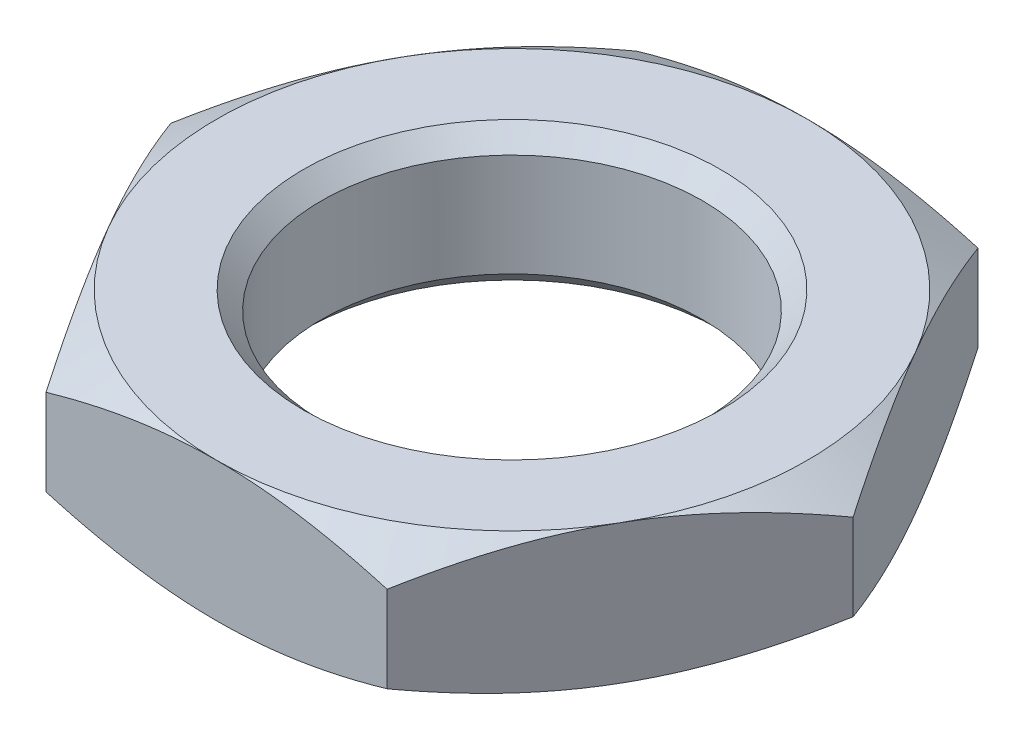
ISO-10303-21;
HEADER;
FILE_DESCRIPTION(('STEP AP214'),'2;1');
FILE_NAME('part.step','',(''),(''),'','','');
FILE_SCHEMA(('AUTOMOTIVE_DESIGN { 1 0 10303 214 1 1 1 1 }'));
ENDSEC;
DATA;
#1=APPLICATION_CONTEXT('core data for automotive mechanical design processes');
#2=APPLICATION_PROTOCOL_DEFINITION('international standard','automotive_design',2000,#1);
#3=PRODUCT_CONTEXT('',#1,'mechanical');
#4=PRODUCT('Part','Part','',(#3));
#5=PRODUCT_RELATED_PRODUCT_CATEGORY('part','',(#4));
#6=PRODUCT_DEFINITION_FORMATION('','',#4);
#7=PRODUCT_DEFINITION_CONTEXT('part definition',#1,'design');
#8=PRODUCT_DEFINITION('design','',#6,#7);
#9=PRODUCT_DEFINITION_SHAPE('','',#8);
#10=(LENGTH_UNIT() NAMED_UNIT(*) SI_UNIT(.MILLI.,.METRE.));
#11=(NAMED_UNIT(*) PLANE_ANGLE_UNIT() SI_UNIT($,.RADIAN.));
#12=(NAMED_UNIT(*) SI_UNIT($,.STERADIAN.) SOLID_ANGLE_UNIT());
#13=UNCERTAINTY_MEASURE_WITH_UNIT(LENGTH_MEASURE(1.E-05),#10,'distance_accuracy_value','');
#14=(GEOMETRIC_REPRESENTATION_CONTEXT(3) GLOBAL_UNCERTAINTY_ASSIGNED_CONTEXT((#13)) GLOBAL_UNIT_ASSIGNED_CONTEXT((#10,
#11,#12)) REPRESENTATION_CONTEXT('',''));
#15=CARTESIAN_POINT('',(0.,0.,0.));
#16=DIRECTION('',(0.,0.,1.));
#17=DIRECTION('',(1.,0.,0.));
#18=AXIS2_PLACEMENT_3D('',#15,#16,#17);
#19=CARTESIAN_POINT('',(7.25,-4.,0.));
#20=DIRECTION('',(0.,1.,0.));
#21=DIRECTION('',(0.,0.,1.));
#22=AXIS2_PLACEMENT_3D('',#19,#20,#21);
#23=PLANE('',#22);
#24=CARTESIAN_POINT('',(0.,-3.99999999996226,0.));
#25=DIRECTION('',(0.,1.,0.));
#26=DIRECTION('',(0.,0.,1.));
#27=AXIS2_PLACEMENT_3D('',#24,#25,#26);
#28=CIRCLE('',#27,6.00000000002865);
#29=CARTESIAN_POINT('',(0.,-3.99999999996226,6.00000000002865));
#30=VERTEX_POINT('',#29);
#31=EDGE_CURVE('E269',#30,#30,#28,.F.);
#32=ORIENTED_EDGE('',*,*,#31,.T.);
#33=EDGE_LOOP('',(#32));
#34=FACE_BOUND('',#33,.T.);
#35=CARTESIAN_POINT('',(0.,-4.,0.));
#36=DIRECTION('',(0.,-1.,0.));
#37=DIRECTION('',(0.,0.,-1.));
#38=AXIS2_PLACEMENT_3D('',#35,#36,#37);
#39=CIRCLE('',#38,8.5);
#40=CARTESIAN_POINT('',(0.,-4.,8.5));
#41=VERTEX_POINT('',#40);
#42=CARTESIAN_POINT('',(-7.36121593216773,-4.,4.25));
#43=VERTEX_POINT('',#42);
#44=EDGE_CURVE('E103',#41,#43,#39,.T.);
#45=ORIENTED_EDGE('',*,*,#44,.F.);
#46=CARTESIAN_POINT('',(0.,-4.,0.));
#47=DIRECTION('',(0.,-1.,0.));
#48=DIRECTION('',(0.,0.,-1.));
#49=AXIS2_PLACEMENT_3D('',#46,#47,#48);
#50=CIRCLE('',#49,8.5);
#51=CARTESIAN_POINT('',(7.36121593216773,-4.,4.25));
#52=VERTEX_POINT('',#51);
#53=EDGE_CURVE('E19',#52,#41,#50,.T.);
#54=ORIENTED_EDGE('',*,*,#53,.F.);
#55=CARTESIAN_POINT('',(0.,-4.,0.));
#56=DIRECTION('',(0.,-1.,0.));
#57=DIRECTION('',(0.,0.,-1.));
#58=AXIS2_PLACEMENT_3D('',#55,#56,#57);
#59=CIRCLE('',#58,8.5);
#60=CARTESIAN_POINT('',(7.36121593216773,-4.,-4.25));
#61=VERTEX_POINT('',#60);
#62=EDGE_CURVE('E543',#61,#52,#59,.T.);
#63=ORIENTED_EDGE('',*,*,#62,.F.);
#64=CARTESIAN_POINT('',(0.,-4.,0.));
#65=DIRECTION('',(0.,-1.,0.));
#66=DIRECTION('',(0.,0.,-1.));
#67=AXIS2_PLACEMENT_3D('',#64,#65,#66);
#68=CIRCLE('',#67,8.5);
#69=CARTESIAN_POINT('',(0.,-4.00000000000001,-8.5));
#70=VERTEX_POINT('',#69);
#71=EDGE_CURVE('E545',#70,#61,#68,.T.);
#72=ORIENTED_EDGE('',*,*,#71,.F.);
#73=CARTESIAN_POINT('',(0.,-4.,0.));
#74=DIRECTION('',(0.,-1.,0.));
#75=DIRECTION('',(0.,0.,-1.));
#76=AXIS2_PLACEMENT_3D('',#73,#74,#75);
#77=CIRCLE('',#76,8.5);
#78=CARTESIAN_POINT('',(-7.36121593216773,-4.,-4.25));
#79=VERTEX_POINT('',#78);
#80=EDGE_CURVE('E548',#79,#70,#77,.T.);
#81=ORIENTED_EDGE('',*,*,#80,.F.);
#82=CARTESIAN_POINT('',(0.,-4.,0.));
#83=DIRECTION('',(0.,-1.,0.));
#84=DIRECTION('',(0.,0.,-1.));
#85=AXIS2_PLACEMENT_3D('',#82,#83,#84);
#86=CIRCLE('',#85,8.5);
#87=EDGE_CURVE('E107',#43,#79,#86,.T.);
#88=ORIENTED_EDGE('',*,*,#87,.F.);
#89=EDGE_LOOP('',(#45,#54,#63,#72,#81,#88));
#90=FACE_BOUND('',#89,.T.);
#91=ADVANCED_FACE('F16',(#34,#90),#23,.T.);
#92=CARTESIAN_POINT('',(0.,-4.76374451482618,0.));
#93=DIRECTION('',(0.,-1.,0.));
#94=DIRECTION('',(0.,0.,-1.));
#95=AXIS2_PLACEMENT_3D('',#92,#93,#94);
#96=CONICAL_SURFACE('',#95,9.82284430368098,1.0471975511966);
#97=CARTESIAN_POINT('',(7.36121593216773,-4.00000000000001,4.25));
#98=CARTESIAN_POINT('',(7.25706849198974,-3.99996526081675,4.43038865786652));
#99=CARTESIAN_POINT('',(7.15292606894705,-4.004419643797,4.61076862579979));
#100=CARTESIAN_POINT('',(6.9448457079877,-4.02204845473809,4.97117438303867));
#101=CARTESIAN_POINT('',(6.84090773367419,-4.03522115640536,5.15120023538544));
#102=CARTESIAN_POINT('',(6.63390762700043,-4.06994166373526,5.50973493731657));
#103=CARTESIAN_POINT('',(6.53084371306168,-4.09144730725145,5.6882468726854));
#104=CARTESIAN_POINT('',(6.32520691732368,-4.14237110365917,6.04442025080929));
#105=CARTESIAN_POINT('',(6.22263404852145,-4.17178946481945,6.22208167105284));
#106=CARTESIAN_POINT('',(5.91607718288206,-4.27100481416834,6.75305373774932));
#107=CARTESIAN_POINT('',(5.71298374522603,-4.35181024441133,7.10482189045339));
#108=CARTESIAN_POINT('',(5.3085433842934,-4.53816823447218,7.80533314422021));
#109=CARTESIAN_POINT('',(5.1072105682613,-4.64384438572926,8.15405181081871));
#110=CARTESIAN_POINT('',(4.90747728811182,-4.75918937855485,8.5));
#111=B_SPLINE_CURVE_WITH_KNOTS('',3,(#97,#98,#99,#100,#101,#102,#103,#104,#105,#106,#107,#108,
#109,#110),.UNSPECIFIED.,.F.,.F.,(4,2,2,2,2,2,4),(0.,0.624820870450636,1.24951805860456,
1.87109489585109,2.49268809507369,3.73424531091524,4.98210763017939),.UNSPECIFIED.);
#112=CARTESIAN_POINT('',(4.90747728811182,-4.75918937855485,8.5));
#113=VERTEX_POINT('',#112);
#114=EDGE_CURVE('E118',#52,#113,#111,.T.);
#115=ORIENTED_EDGE('',*,*,#114,.F.);
#116=ORIENTED_EDGE('',*,*,#53,.T.);
#117=CARTESIAN_POINT('',(4.90747728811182,-4.75918937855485,8.5));
#118=CARTESIAN_POINT('',(4.50801072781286,-4.64384438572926,8.5));
#119=CARTESIAN_POINT('',(4.10534509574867,-4.53816823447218,8.5));
#120=CARTESIAN_POINT('',(3.2964643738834,-4.35181024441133,8.5));
#121=CARTESIAN_POINT('',(2.89027749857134,-4.27100481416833,8.5));
#122=CARTESIAN_POINT('',(2.27716376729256,-4.17178946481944,8.5));
#123=CARTESIAN_POINT('',(2.07201802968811,-4.14237110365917,8.5));
#124=CARTESIAN_POINT('',(1.66074443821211,-4.09144730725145,8.5));
#125=CARTESIAN_POINT('',(1.45461661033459,-4.06994166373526,8.5));
#126=CARTESIAN_POINT('',(1.04061639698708,-4.03522115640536,8.5));
#127=CARTESIAN_POINT('',(0.832740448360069,-4.02204845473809,8.5));
#128=CARTESIAN_POINT('',(0.416579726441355,-4.004419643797,8.5));
#129=CARTESIAN_POINT('',(0.208294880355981,-3.99996526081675,8.5));
#130=CARTESIAN_POINT('',(0.,-4.00000000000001,8.5));
#131=B_SPLINE_CURVE_WITH_KNOTS('',3,(#117,#118,#119,#120,#121,#122,#123,#124,#125,#126,#127,
#128,#129,#130),.UNSPECIFIED.,.F.,.F.,(4,2,2,2,2,2,4),(0.,1.24786231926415,2.4894195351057,
3.11101273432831,3.73258957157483,4.35728675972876,4.98210763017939),.UNSPECIFIED.);
#132=EDGE_CURVE('E116',#113,#41,#131,.T.);
#133=ORIENTED_EDGE('',*,*,#132,.F.);
#134=EDGE_LOOP('',(#115,#116,#133));
#135=FACE_BOUND('',#134,.T.);
#136=ADVANCED_FACE('F114',(#135),#96,.T.);
#137=CARTESIAN_POINT('',(0.,-4.76374451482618,0.));
#138=DIRECTION('',(0.,-1.,0.));
#139=DIRECTION('',(0.,0.,-1.));
#140=AXIS2_PLACEMENT_3D('',#137,#138,#139);
#141=CONICAL_SURFACE('',#140,9.82284430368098,1.0471975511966);
#142=ORIENTED_EDGE('',*,*,#44,.T.);
#143=CARTESIAN_POINT('',(-4.90747728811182,-4.75918937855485,8.5));
#144=CARTESIAN_POINT('',(-5.1072105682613,-4.64384438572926,8.15405181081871));
#145=CARTESIAN_POINT('',(-5.3085433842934,-4.53816823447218,7.8053331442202));
#146=CARTESIAN_POINT('',(-5.71298374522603,-4.35181024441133,7.10482189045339));
#147=CARTESIAN_POINT('',(-5.91607718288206,-4.27100481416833,6.75305373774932));
#148=CARTESIAN_POINT('',(-6.22263404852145,-4.17178946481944,6.22208167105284));
#149=CARTESIAN_POINT('',(-6.32520691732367,-4.14237110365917,6.04442025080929));
#150=CARTESIAN_POINT('',(-6.53084371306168,-4.09144730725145,5.6882468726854));
#151=CARTESIAN_POINT('',(-6.63390762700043,-4.06994166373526,5.50973493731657));
#152=CARTESIAN_POINT('',(-6.84090773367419,-4.03522115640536,5.15120023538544));
#153=CARTESIAN_POINT('',(-6.94484570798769,-4.02204845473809,4.97117438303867));
#154=CARTESIAN_POINT('',(-7.15292606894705,-4.004419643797,4.61076862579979));
#155=CARTESIAN_POINT('',(-7.25706849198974,-3.99996526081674,4.43038865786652));
#156=CARTESIAN_POINT('',(-7.36121593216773,-4.00000000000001,4.25));
#157=B_SPLINE_CURVE_WITH_KNOTS('',3,(#143,#144,#145,#146,#147,#148,#149,#150,#151,#152,#153,
#154,#155,#156),.UNSPECIFIED.,.F.,.F.,(4,2,2,2,2,2,4),(0.,1.24786231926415,2.4894195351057,
3.1110127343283,3.73258957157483,4.35728675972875,4.98210763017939),.UNSPECIFIED.);
#158=CARTESIAN_POINT('',(-4.90747728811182,-4.75918937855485,8.5));
#159=VERTEX_POINT('',#158);
#160=EDGE_CURVE('E123',#159,#43,#157,.T.);
#161=ORIENTED_EDGE('',*,*,#160,.F.);
#162=CARTESIAN_POINT('',(0.,-4.00000000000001,8.5));
#163=CARTESIAN_POINT('',(-0.208294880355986,-3.99996526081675,8.5));
#164=CARTESIAN_POINT('',(-0.416579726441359,-4.004419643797,8.5));
#165=CARTESIAN_POINT('',(-0.832740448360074,-4.02204845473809,8.5));
#166=CARTESIAN_POINT('',(-1.04061639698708,-4.03522115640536,8.5));
#167=CARTESIAN_POINT('',(-1.4546166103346,-4.06994166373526,8.5));
#168=CARTESIAN_POINT('',(-1.66074443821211,-4.09144730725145,8.5));
#169=CARTESIAN_POINT('',(-2.07201802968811,-4.14237110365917,8.5));
#170=CARTESIAN_POINT('',(-2.27716376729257,-4.17178946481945,8.5));
#171=CARTESIAN_POINT('',(-2.89027749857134,-4.27100481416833,8.5));
#172=CARTESIAN_POINT('',(-3.2964643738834,-4.35181024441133,8.5));
#173=CARTESIAN_POINT('',(-4.10534509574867,-4.53816823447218,8.5));
#174=CARTESIAN_POINT('',(-4.50801072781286,-4.64384438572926,8.5));
#175=CARTESIAN_POINT('',(-4.90747728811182,-4.75918937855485,8.5));
#176=B_SPLINE_CURVE_WITH_KNOTS('',3,(#162,#163,#164,#165,#166,#167,#168,#169,#170,#171,#172,
#173,#174,#175),.UNSPECIFIED.,.F.,.F.,(4,2,2,2,2,2,4),(0.,0.624820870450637,1.24951805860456,
1.87109489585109,2.49268809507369,3.73424531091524,4.98210763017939),.UNSPECIFIED.);
#177=EDGE_CURVE('E120',#41,#159,#176,.T.);
#178=ORIENTED_EDGE('',*,*,#177,.F.);
#179=EDGE_LOOP('',(#142,#161,#178));
#180=FACE_BOUND('',#179,.T.);
#181=ADVANCED_FACE('F121',(#180),#141,.T.);
#182=CARTESIAN_POINT('',(0.,-4.76374451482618,0.));
#183=DIRECTION('',(0.,-1.,0.));
#184=DIRECTION('',(0.,0.,-1.));
#185=AXIS2_PLACEMENT_3D('',#182,#183,#184);
#186=CONICAL_SURFACE('',#185,9.82284430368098,1.0471975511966);
#187=ORIENTED_EDGE('',*,*,#87,.T.);
#188=CARTESIAN_POINT('',(-9.81495457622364,-4.75918937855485,0.));
#189=CARTESIAN_POINT('',(-9.61522129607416,-4.64384438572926,-0.345948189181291));
#190=CARTESIAN_POINT('',(-9.41388848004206,-4.53816823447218,-0.694666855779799));
#191=CARTESIAN_POINT('',(-9.00944811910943,-4.35181024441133,-1.39517810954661));
#192=CARTESIAN_POINT('',(-8.8063546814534,-4.27100481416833,-1.74694626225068));
#193=CARTESIAN_POINT('',(-8.49979781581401,-4.17178946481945,-2.27791832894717));
#194=CARTESIAN_POINT('',(-8.39722494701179,-4.14237110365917,-2.45557974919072));
#195=CARTESIAN_POINT('',(-8.19158815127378,-4.09144730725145,-2.8117531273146));
#196=CARTESIAN_POINT('',(-8.08852423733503,-4.06994166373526,-2.99026506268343));
#197=CARTESIAN_POINT('',(-7.88152413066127,-4.03522115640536,-3.34879976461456));
#198=CARTESIAN_POINT('',(-7.77758615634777,-4.02204845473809,-3.52882561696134));
#199=CARTESIAN_POINT('',(-7.56950579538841,-4.004419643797,-3.88923137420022));
#200=CARTESIAN_POINT('',(-7.46536337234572,-3.99996526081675,-4.06961134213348));
#201=CARTESIAN_POINT('',(-7.36121593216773,-4.00000000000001,-4.25));
#202=B_SPLINE_CURVE_WITH_KNOTS('',3,(#188,#189,#190,#191,#192,#193,#194,#195,#196,#197,#198,
#199,#200,#201),.UNSPECIFIED.,.F.,.F.,(4,2,2,2,2,2,4),(0.,1.24786231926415,2.48941953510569,
3.1110127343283,3.73258957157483,4.35728675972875,4.98210763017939),.UNSPECIFIED.);
#203=CARTESIAN_POINT('',(-9.81495457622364,-4.75918937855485,0.));
#204=VERTEX_POINT('',#203);
#205=EDGE_CURVE('E381',#204,#79,#202,.T.);
#206=ORIENTED_EDGE('',*,*,#205,.F.);
#207=CARTESIAN_POINT('',(-7.36121593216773,-4.00000000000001,4.25));
#208=CARTESIAN_POINT('',(-7.46536337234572,-3.99996526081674,4.06961134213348));
#209=CARTESIAN_POINT('',(-7.56950579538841,-4.004419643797,3.88923137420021));
#210=CARTESIAN_POINT('',(-7.77758615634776,-4.02204845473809,3.52882561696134));
#211=CARTESIAN_POINT('',(-7.88152413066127,-4.03522115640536,3.34879976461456));
#212=CARTESIAN_POINT('',(-8.08852423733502,-4.06994166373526,2.99026506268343));
#213=CARTESIAN_POINT('',(-8.19158815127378,-4.09144730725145,2.8117531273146));
#214=CARTESIAN_POINT('',(-8.39722494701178,-4.14237110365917,2.45557974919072));
#215=CARTESIAN_POINT('',(-8.49979781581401,-4.17178946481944,2.27791832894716));
#216=CARTESIAN_POINT('',(-8.8063546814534,-4.27100481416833,1.74694626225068));
#217=CARTESIAN_POINT('',(-9.00944811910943,-4.35181024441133,1.39517810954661));
#218=CARTESIAN_POINT('',(-9.41388848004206,-4.53816823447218,0.694666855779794));
#219=CARTESIAN_POINT('',(-9.61522129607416,-4.64384438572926,0.345948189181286));
#220=CARTESIAN_POINT('',(-9.81495457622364,-4.75918937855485,0.));
#221=B_SPLINE_CURVE_WITH_KNOTS('',3,(#207,#208,#209,#210,#211,#212,#213,#214,#215,#216,#217,
#218,#219,#220),.UNSPECIFIED.,.F.,.F.,(4,2,2,2,2,2,4),(0.,0.624820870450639,1.24951805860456,
1.87109489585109,2.4926880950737,3.73424531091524,4.98210763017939),.UNSPECIFIED.);
#222=EDGE_CURVE('E164',#43,#204,#221,.T.);
#223=ORIENTED_EDGE('',*,*,#222,.F.);
#224=EDGE_LOOP('',(#187,#206,#223));
#225=FACE_BOUND('',#224,.T.);
#226=ADVANCED_FACE('F156',(#225),#186,.T.);
#227=CARTESIAN_POINT('',(0.,-4.76374451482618,0.));
#228=DIRECTION('',(0.,-1.,0.));
#229=DIRECTION('',(0.,0.,-1.));
#230=AXIS2_PLACEMENT_3D('',#227,#228,#229);
#231=CONICAL_SURFACE('',#230,9.82284430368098,1.0471975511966);
#232=ORIENTED_EDGE('',*,*,#80,.T.);
#233=CARTESIAN_POINT('',(-4.90747728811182,-4.75918937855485,-8.5));
#234=CARTESIAN_POINT('',(-4.50801072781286,-4.64384438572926,-8.5));
#235=CARTESIAN_POINT('',(-4.10534509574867,-4.53816823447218,-8.5));
#236=CARTESIAN_POINT('',(-3.2964643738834,-4.35181024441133,-8.5));
#237=CARTESIAN_POINT('',(-2.89027749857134,-4.27100481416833,-8.5));
#238=CARTESIAN_POINT('',(-2.27716376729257,-4.17178946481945,-8.5));
#239=CARTESIAN_POINT('',(-2.07201802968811,-4.14237110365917,-8.5));
#240=CARTESIAN_POINT('',(-1.66074443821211,-4.09144730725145,-8.5));
#241=CARTESIAN_POINT('',(-1.4546166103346,-4.06994166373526,-8.5));
#242=CARTESIAN_POINT('',(-1.04061639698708,-4.03522115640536,-8.5));
#243=CARTESIAN_POINT('',(-0.832740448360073,-4.02204845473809,-8.5));
#244=CARTESIAN_POINT('',(-0.416579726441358,-4.004419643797,-8.5));
#245=CARTESIAN_POINT('',(-0.208294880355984,-3.99996526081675,-8.5));
#246=CARTESIAN_POINT('',(0.,-4.00000000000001,-8.5));
#247=B_SPLINE_CURVE_WITH_KNOTS('',3,(#233,#234,#235,#236,#237,#238,#239,#240,#241,#242,#243,
#244,#245,#246),.UNSPECIFIED.,.F.,.F.,(4,2,2,2,2,2,4),(0.,1.24786231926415,2.4894195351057,
3.1110127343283,3.73258957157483,4.35728675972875,4.98210763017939),.UNSPECIFIED.);
#248=CARTESIAN_POINT('',(-4.90747728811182,-4.75918937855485,-8.5));
#249=VERTEX_POINT('',#248);
#250=EDGE_CURVE('E376',#249,#70,#247,.T.);
#251=ORIENTED_EDGE('',*,*,#250,.F.);
#252=CARTESIAN_POINT('',(-7.36121593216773,-4.00000000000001,-4.25));
#253=CARTESIAN_POINT('',(-7.25706849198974,-3.99996526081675,-4.43038865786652));
#254=CARTESIAN_POINT('',(-7.15292606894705,-4.004419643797,-4.61076862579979));
#255=CARTESIAN_POINT('',(-6.9448457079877,-4.02204845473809,-4.97117438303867));
#256=CARTESIAN_POINT('',(-6.84090773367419,-4.03522115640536,-5.15120023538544));
#257=CARTESIAN_POINT('',(-6.63390762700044,-4.06994166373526,-5.50973493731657));
#258=CARTESIAN_POINT('',(-6.53084371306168,-4.09144730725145,-5.6882468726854));
#259=CARTESIAN_POINT('',(-6.32520691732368,-4.14237110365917,-6.04442025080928));
#260=CARTESIAN_POINT('',(-6.22263404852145,-4.17178946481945,-6.22208167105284));
#261=CARTESIAN_POINT('',(-5.91607718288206,-4.27100481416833,-6.75305373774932));
#262=CARTESIAN_POINT('',(-5.71298374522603,-4.35181024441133,-7.10482189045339));
#263=CARTESIAN_POINT('',(-5.3085433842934,-4.53816823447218,-7.8053331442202));
#264=CARTESIAN_POINT('',(-5.1072105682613,-4.64384438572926,-8.15405181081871));
#265=CARTESIAN_POINT('',(-4.90747728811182,-4.75918937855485,-8.5));
#266=B_SPLINE_CURVE_WITH_KNOTS('',3,(#252,#253,#254,#255,#256,#257,#258,#259,#260,#261,#262,
#263,#264,#265),.UNSPECIFIED.,.F.,.F.,(4,2,2,2,2,2,4),(0.,0.624820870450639,1.24951805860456,
1.87109489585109,2.49268809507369,3.73424531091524,4.98210763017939),.UNSPECIFIED.);
#267=EDGE_CURVE('E377',#79,#249,#266,.T.);
#268=ORIENTED_EDGE('',*,*,#267,.F.);
#269=EDGE_LOOP('',(#232,#251,#268));
#270=FACE_BOUND('',#269,.T.);
#271=ADVANCED_FACE('F280',(#270),#231,.T.);
#272=CARTESIAN_POINT('',(0.,-4.76374451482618,0.));
#273=DIRECTION('',(0.,-1.,0.));
#274=DIRECTION('',(0.,0.,-1.));
#275=AXIS2_PLACEMENT_3D('',#272,#273,#274);
#276=CONICAL_SURFACE('',#275,9.82284430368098,1.0471975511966);
#277=CARTESIAN_POINT('',(0.,-4.00000000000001,-8.5));
#278=CARTESIAN_POINT('',(0.208294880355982,-3.99996526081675,-8.5));
#279=CARTESIAN_POINT('',(0.416579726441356,-4.004419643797,-8.5));
#280=CARTESIAN_POINT('',(0.832740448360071,-4.02204845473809,-8.5));
#281=CARTESIAN_POINT('',(1.04061639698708,-4.03522115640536,-8.5));
#282=CARTESIAN_POINT('',(1.45461661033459,-4.06994166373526,-8.5));
#283=CARTESIAN_POINT('',(1.66074443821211,-4.09144730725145,-8.5));
#284=CARTESIAN_POINT('',(2.07201802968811,-4.14237110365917,-8.5));
#285=CARTESIAN_POINT('',(2.27716376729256,-4.17178946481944,-8.5));
#286=CARTESIAN_POINT('',(2.89027749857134,-4.27100481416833,-8.5));
#287=CARTESIAN_POINT('',(3.2964643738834,-4.35181024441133,-8.5));
#288=CARTESIAN_POINT('',(4.10534509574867,-4.53816823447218,-8.5));
#289=CARTESIAN_POINT('',(4.50801072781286,-4.64384438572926,-8.5));
#290=CARTESIAN_POINT('',(4.90747728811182,-4.75918937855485,-8.5));
#291=B_SPLINE_CURVE_WITH_KNOTS('',3,(#277,#278,#279,#280,#281,#282,#283,#284,#285,#286,#287,
#288,#289,#290),.UNSPECIFIED.,.F.,.F.,(4,2,2,2,2,2,4),(0.,0.624820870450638,1.24951805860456,
1.87109489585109,2.4926880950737,3.73424531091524,4.98210763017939),.UNSPECIFIED.);
#292=CARTESIAN_POINT('',(4.90747728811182,-4.75918937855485,-8.5));
#293=VERTEX_POINT('',#292);
#294=EDGE_CURVE('E285',#70,#293,#291,.T.);
#295=ORIENTED_EDGE('',*,*,#294,.F.);
#296=ORIENTED_EDGE('',*,*,#71,.T.);
#297=CARTESIAN_POINT('',(4.90747728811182,-4.75918937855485,-8.5));
#298=CARTESIAN_POINT('',(5.1072105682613,-4.64384438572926,-8.15405181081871));
#299=CARTESIAN_POINT('',(5.3085433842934,-4.53816823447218,-7.8053331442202));
#300=CARTESIAN_POINT('',(5.71298374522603,-4.35181024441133,-7.10482189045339));
#301=CARTESIAN_POINT('',(5.91607718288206,-4.27100481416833,-6.75305373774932));
#302=CARTESIAN_POINT('',(6.22263404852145,-4.17178946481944,-6.22208167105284));
#303=CARTESIAN_POINT('',(6.32520691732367,-4.14237110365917,-6.04442025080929));
#304=CARTESIAN_POINT('',(6.53084371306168,-4.09144730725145,-5.6882468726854));
#305=CARTESIAN_POINT('',(6.63390762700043,-4.06994166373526,-5.50973493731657));
#306=CARTESIAN_POINT('',(6.84090773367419,-4.03522115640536,-5.15120023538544));
#307=CARTESIAN_POINT('',(6.94484570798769,-4.02204845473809,-4.97117438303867));
#308=CARTESIAN_POINT('',(7.15292606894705,-4.004419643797,-4.61076862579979));
#309=CARTESIAN_POINT('',(7.25706849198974,-3.99996526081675,-4.43038865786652));
#310=CARTESIAN_POINT('',(7.36121593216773,-4.00000000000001,-4.25));
#311=B_SPLINE_CURVE_WITH_KNOTS('',3,(#297,#298,#299,#300,#301,#302,#303,#304,#305,#306,#307,
#308,#309,#310),.UNSPECIFIED.,.F.,.F.,(4,2,2,2,2,2,4),(0.,1.24786231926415,2.48941953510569,
3.1110127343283,3.73258957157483,4.35728675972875,4.98210763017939),.UNSPECIFIED.);
#312=EDGE_CURVE('E290',#293,#61,#311,.T.);
#313=ORIENTED_EDGE('',*,*,#312,.F.);
#314=EDGE_LOOP('',(#295,#296,#313));
#315=FACE_BOUND('',#314,.T.);
#316=ADVANCED_FACE('F275',(#315),#276,.T.);
#317=CARTESIAN_POINT('',(0.,-4.76374451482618,0.));
#318=DIRECTION('',(0.,-1.,0.));
#319=DIRECTION('',(0.,0.,-1.));
#320=AXIS2_PLACEMENT_3D('',#317,#318,#319);
#321=CONICAL_SURFACE('',#320,9.82284430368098,1.0471975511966);
#322=CARTESIAN_POINT('',(7.36121593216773,-4.,-4.25));
#323=CARTESIAN_POINT('',(7.46536337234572,-3.99996526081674,-4.06961134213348));
#324=CARTESIAN_POINT('',(7.56950579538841,-4.004419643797,-3.88923137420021));
#325=CARTESIAN_POINT('',(7.77758615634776,-4.02204845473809,-3.52882561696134));
#326=CARTESIAN_POINT('',(7.88152413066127,-4.03522115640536,-3.34879976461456));
#327=CARTESIAN_POINT('',(8.08852423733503,-4.06994166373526,-2.99026506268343));
#328=CARTESIAN_POINT('',(8.19158815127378,-4.09144730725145,-2.8117531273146));
#329=CARTESIAN_POINT('',(8.39722494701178,-4.14237110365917,-2.45557974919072));
#330=CARTESIAN_POINT('',(8.49979781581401,-4.17178946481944,-2.27791832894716));
#331=CARTESIAN_POINT('',(8.8063546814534,-4.27100481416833,-1.74694626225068));
#332=CARTESIAN_POINT('',(9.00944811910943,-4.35181024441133,-1.39517810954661));
#333=CARTESIAN_POINT('',(9.41388848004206,-4.53816823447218,-0.694666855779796));
#334=CARTESIAN_POINT('',(9.61522129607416,-4.64384438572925,-0.345948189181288));
#335=CARTESIAN_POINT('',(9.81495457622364,-4.75918937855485,0.));
#336=B_SPLINE_CURVE_WITH_KNOTS('',3,(#322,#323,#324,#325,#326,#327,#328,#329,#330,#331,#332,
#333,#334,#335),.UNSPECIFIED.,.F.,.F.,(4,2,2,2,2,2,4),(0.,0.624820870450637,1.24951805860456,
1.87109489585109,2.4926880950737,3.73424531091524,4.98210763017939),.UNSPECIFIED.);
#337=CARTESIAN_POINT('',(9.81495457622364,-4.75918937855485,0.));
#338=VERTEX_POINT('',#337);
#339=EDGE_CURVE('E246',#61,#338,#336,.T.);
#340=ORIENTED_EDGE('',*,*,#339,.F.);
#341=ORIENTED_EDGE('',*,*,#62,.T.);
#342=CARTESIAN_POINT('',(9.81495457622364,-4.75918937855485,0.));
#343=CARTESIAN_POINT('',(9.61522129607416,-4.64384438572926,0.34594818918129));
#344=CARTESIAN_POINT('',(9.41388848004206,-4.53816823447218,0.694666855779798));
#345=CARTESIAN_POINT('',(9.00944811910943,-4.35181024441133,1.39517810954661));
#346=CARTESIAN_POINT('',(8.8063546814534,-4.27100481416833,1.74694626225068));
#347=CARTESIAN_POINT('',(8.49979781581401,-4.17178946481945,2.27791832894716));
#348=CARTESIAN_POINT('',(8.39722494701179,-4.14237110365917,2.45557974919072));
#349=CARTESIAN_POINT('',(8.19158815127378,-4.09144730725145,2.8117531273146));
#350=CARTESIAN_POINT('',(8.08852423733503,-4.06994166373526,2.99026506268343));
#351=CARTESIAN_POINT('',(7.88152413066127,-4.03522115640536,3.34879976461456));
#352=CARTESIAN_POINT('',(7.77758615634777,-4.02204845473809,3.52882561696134));
#353=CARTESIAN_POINT('',(7.56950579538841,-4.004419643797,3.88923137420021));
#354=CARTESIAN_POINT('',(7.46536337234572,-3.99996526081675,4.06961134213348));
#355=CARTESIAN_POINT('',(7.36121593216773,-4.00000000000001,4.25));
#356=B_SPLINE_CURVE_WITH_KNOTS('',3,(#342,#343,#344,#345,#346,#347,#348,#349,#350,#351,#352,
#353,#354,#355),.UNSPECIFIED.,.F.,.F.,(4,2,2,2,2,2,4),(0.,1.24786231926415,2.48941953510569,
3.1110127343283,3.73258957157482,4.35728675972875,4.98210763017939),.UNSPECIFIED.);
#357=EDGE_CURVE('E264',#338,#52,#356,.T.);
#358=ORIENTED_EDGE('',*,*,#357,.F.);
#359=EDGE_LOOP('',(#340,#341,#358));
#360=FACE_BOUND('',#359,.T.);
#361=ADVANCED_FACE('F271',(#360),#321,.T.);
#362=CARTESIAN_POINT('',(0.,-3.99999999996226,0.));
#363=DIRECTION('',(0.,1.,0.));
#364=DIRECTION('',(0.,0.,1.));
#365=AXIS2_PLACEMENT_3D('',#362,#363,#364);
#366=CONICAL_SURFACE('',#365,6.00000000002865,0.785398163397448);
#367=CARTESIAN_POINT('',(0.,-4.5196,0.));
#368=DIRECTION('',(0.,-1.,0.));
#369=DIRECTION('',(0.,0.,-1.));
#370=AXIS2_PLACEMENT_3D('',#367,#368,#369);
#371=CIRCLE('',#370,5.4804);
#372=CARTESIAN_POINT('',(0.,-4.5196,-5.4804));
#373=VERTEX_POINT('',#372);
#374=EDGE_CURVE('E245',#373,#373,#371,.T.);
#375=ORIENTED_EDGE('',*,*,#374,.T.);
#376=EDGE_LOOP('',(#375));
#377=FACE_BOUND('',#376,.T.);
#378=ORIENTED_EDGE('',*,*,#31,.F.);
#379=EDGE_LOOP('',(#378));
#380=FACE_BOUND('',#379,.T.);
#381=ADVANCED_FACE('F259',(#377,#380),#366,.F.);
#382=CARTESIAN_POINT('',(9.81495457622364,-9.,0.));
#383=DIRECTION('',(0.866025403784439,0.,0.5));
#384=DIRECTION('',(0.5,0.,-0.866025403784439));
#385=AXIS2_PLACEMENT_3D('',#382,#383,#384);
#386=PLANE('',#385);
#387=ORIENTED_EDGE('',*,*,#114,.T.);
#388=DIRECTION('',(0.,-1.,0.));
#389=VECTOR('',#388,1.);
#390=CARTESIAN_POINT('',(4.90747728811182,-9.,8.5));
#391=LINE('',#390,#389);
#392=CARTESIAN_POINT('',(4.90747724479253,-7.24081063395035,8.5));
#393=VERTEX_POINT('',#392);
#394=EDGE_CURVE('E130',#393,#113,#391,.F.);
#395=ORIENTED_EDGE('',*,*,#394,.F.);
#396=CARTESIAN_POINT('',(7.36121593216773,-7.99999999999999,4.25));
#397=CARTESIAN_POINT('',(7.25706849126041,-8.00003473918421,4.43038865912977));
#398=CARTESIAN_POINT('',(7.15292606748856,-7.99558035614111,4.61076862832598));
#399=CARTESIAN_POINT('',(6.9448457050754,-7.9779515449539,4.97117438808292));
#400=CARTESIAN_POINT('',(6.84090773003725,-7.96477884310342,5.15120024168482));
#401=CARTESIAN_POINT('',(6.63390762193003,-7.93005833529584,5.50973494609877));
#402=CARTESIAN_POINT('',(6.5308437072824,-7.90855269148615,5.6882468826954));
#403=CARTESIAN_POINT('',(6.32520691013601,-7.85762889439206,6.04442026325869));
#404=CARTESIAN_POINT('',(6.22263404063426,-7.82821053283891,6.22208168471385));
#405=CARTESIAN_POINT('',(5.91607717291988,-7.72899518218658,6.75305375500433));
#406=CARTESIAN_POINT('',(5.71298373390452,-7.64818975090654,7.10482191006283));
#407=CARTESIAN_POINT('',(5.30854337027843,-7.46183175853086,7.80533316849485));
#408=CARTESIAN_POINT('',(5.10721055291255,-7.35615560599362,8.15405183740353));
#409=CARTESIAN_POINT('',(4.9074772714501,-7.2408106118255,8.50000002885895));
#410=B_SPLINE_CURVE_WITH_KNOTS('',3,(#396,#397,#398,#399,#400,#401,#402,#403,#404,#405,#406,
#407,#408,#409),.UNSPECIFIED.,.F.,.F.,(4,2,2,2,2,2,4),(0.,0.624820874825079,1.24951806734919,
1.87109490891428,2.49268811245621,3.73424533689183,4.98210766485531),.UNSPECIFIED.);
#411=CARTESIAN_POINT('',(7.36121593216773,-7.99999999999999,4.25));
#412=VERTEX_POINT('',#411);
#413=EDGE_CURVE('E228',#412,#393,#410,.T.);
#414=ORIENTED_EDGE('',*,*,#413,.F.);
#415=CARTESIAN_POINT('',(9.81495457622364,-7.24081062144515,0.));
#416=CARTESIAN_POINT('',(9.61522129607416,-7.35615561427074,0.345948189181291));
#417=CARTESIAN_POINT('',(9.41388848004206,-7.46183176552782,0.694666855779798));
#418=CARTESIAN_POINT('',(9.00944811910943,-7.64818975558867,1.39517810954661));
#419=CARTESIAN_POINT('',(8.8063546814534,-7.72899518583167,1.74694626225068));
#420=CARTESIAN_POINT('',(8.49979781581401,-7.82821053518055,2.27791832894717));
#421=CARTESIAN_POINT('',(8.39722494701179,-7.85762889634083,2.45557974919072));
#422=CARTESIAN_POINT('',(8.19158815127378,-7.90855269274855,2.8117531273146));
#423=CARTESIAN_POINT('',(8.08852423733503,-7.93005833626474,2.99026506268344));
#424=CARTESIAN_POINT('',(7.88152413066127,-7.96477884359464,3.34879976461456));
#425=CARTESIAN_POINT('',(7.77758615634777,-7.97795154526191,3.52882561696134));
#426=CARTESIAN_POINT('',(7.56950579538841,-7.995580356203,3.88923137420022));
#427=CARTESIAN_POINT('',(7.46536337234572,-8.00003473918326,4.06961134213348));
#428=CARTESIAN_POINT('',(7.36121593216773,-7.99999999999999,4.25));
#429=B_SPLINE_CURVE_WITH_KNOTS('',3,(#415,#416,#417,#418,#419,#420,#421,#422,#423,#424,#425,
#426,#427,#428),.UNSPECIFIED.,.F.,.F.,(4,2,2,2,2,2,4),(0.,1.24786231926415,2.4894195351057,
3.1110127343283,3.73258957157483,4.35728675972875,4.98210763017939),.UNSPECIFIED.);
#430=CARTESIAN_POINT('',(9.81495457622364,-7.24081062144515,0.));
#431=VERTEX_POINT('',#430);
#432=EDGE_CURVE('E239',#431,#412,#429,.T.);
#433=ORIENTED_EDGE('',*,*,#432,.F.);
#434=DIRECTION('',(0.,1.,0.));
#435=VECTOR('',#434,1.);
#436=CARTESIAN_POINT('',(9.81495457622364,-9.,0.));
#437=LINE('',#436,#435);
#438=EDGE_CURVE('E368',#338,#431,#437,.F.);
#439=ORIENTED_EDGE('',*,*,#438,.F.);
#440=ORIENTED_EDGE('',*,*,#357,.T.);
#441=EDGE_LOOP('',(#387,#395,#414,#433,#439,#440));
#442=FACE_BOUND('',#441,.T.);
#443=ADVANCED_FACE('F255',(#442),#386,.T.);
#444=CARTESIAN_POINT('',(4.90747728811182,-9.,8.5));
#445=DIRECTION('',(0.,0.,1.));
#446=DIRECTION('',(0.,-1.,0.));
#447=AXIS2_PLACEMENT_3D('',#444,#445,#446);
#448=PLANE('',#447);
#449=ORIENTED_EDGE('',*,*,#177,.T.);
#450=DIRECTION('',(0.,1.,0.));
#451=VECTOR('',#450,1.);
#452=CARTESIAN_POINT('',(-4.90747728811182,-9.,8.5));
#453=LINE('',#452,#451);
#454=CARTESIAN_POINT('',(-4.90747730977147,-7.24081063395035,8.49999996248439));
#455=VERTEX_POINT('',#454);
#456=EDGE_CURVE('E126',#455,#159,#453,.T.);
#457=ORIENTED_EDGE('',*,*,#456,.F.);
#458=CARTESIAN_POINT('',(0.,-7.99999999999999,8.5));
#459=CARTESIAN_POINT('',(-0.208294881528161,-8.00003473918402,8.5));
#460=CARTESIAN_POINT('',(-0.416579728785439,-7.99558035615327,8.5));
#461=CARTESIAN_POINT('',(-0.832740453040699,-7.9779515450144,8.5));
#462=CARTESIAN_POINT('',(-1.04061640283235,-7.9647788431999,8.5));
#463=CARTESIAN_POINT('',(-1.45461661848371,-7.93005833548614,8.5));
#464=CARTESIAN_POINT('',(-1.66074444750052,-7.90855269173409,8.5));
#465=CARTESIAN_POINT('',(-2.07201804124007,-7.85762889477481,8.5));
#466=CARTESIAN_POINT('',(-2.27716377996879,-7.82821053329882,8.5));
#467=CARTESIAN_POINT('',(-2.89027751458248,-7.7289951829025,8.5));
#468=CARTESIAN_POINT('',(-3.29646439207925,-7.64818975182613,8.5));
#469=CARTESIAN_POINT('',(-4.10534511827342,-7.46183175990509,8.5));
#470=CARTESIAN_POINT('',(-4.50801075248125,-7.35615560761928,8.5));
#471=CARTESIAN_POINT('',(-4.9074773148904,-7.24081061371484,8.5));
#472=B_SPLINE_CURVE_WITH_KNOTS('',3,(#458,#459,#460,#461,#462,#463,#464,#465,#466,#467,#468,
#469,#470,#471),.UNSPECIFIED.,.F.,.F.,(4,2,2,2,2,2,4),(0.,0.624820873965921,1.24951806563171,
1.87109490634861,2.49268810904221,3.73424533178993,4.98210765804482),.UNSPECIFIED.);
#473=CARTESIAN_POINT('',(0.,-8.,8.5));
#474=VERTEX_POINT('',#473);
#475=EDGE_CURVE('E197',#474,#455,#472,.T.);
#476=ORIENTED_EDGE('',*,*,#475,.F.);
#477=CARTESIAN_POINT('',(4.90747720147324,-7.24081064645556,8.5));
#478=CARTESIAN_POINT('',(4.50801064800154,-7.35615563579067,8.5));
#479=CARTESIAN_POINT('',(4.1053450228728,-7.46183178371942,8.5));
#480=CARTESIAN_POINT('',(3.29646431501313,-7.64818976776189,8.5));
#481=CARTESIAN_POINT('',(2.89027744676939,-7.72899519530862,8.5));
#482=CARTESIAN_POINT('',(2.27716372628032,-7.82821054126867,8.5));
#483=CARTESIAN_POINT('',(2.07201799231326,-7.8576289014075,8.5));
#484=CARTESIAN_POINT('',(1.66074440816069,-7.90855269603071,8.5));
#485=CARTESIAN_POINT('',(1.4546165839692,-7.93005833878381,8.5));
#486=CARTESIAN_POINT('',(1.04061637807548,-7.96477884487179,8.5));
#487=CARTESIAN_POINT('',(0.832740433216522,-7.97795154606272,8.5));
#488=CARTESIAN_POINT('',(0.416579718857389,-7.99558035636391,8.5));
#489=CARTESIAN_POINT('',(0.208294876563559,-8.00003473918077,8.5));
#490=CARTESIAN_POINT('',(0.,-7.99999999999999,8.5));
#491=B_SPLINE_CURVE_WITH_KNOTS('',3,(#477,#478,#479,#480,#481,#482,#483,#484,#485,#486,#487,
#488,#489,#490),.UNSPECIFIED.,.F.,.F.,(4,2,2,2,2,2,4),(0.,1.24786229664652,2.48941949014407,
3.11101267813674,3.7325895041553,4.35728668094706,4.98210754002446),.UNSPECIFIED.);
#492=EDGE_CURVE('E233',#393,#474,#491,.T.);
#493=ORIENTED_EDGE('',*,*,#492,.F.);
#494=ORIENTED_EDGE('',*,*,#394,.T.);
#495=ORIENTED_EDGE('',*,*,#132,.T.);
#496=EDGE_LOOP('',(#449,#457,#476,#493,#494,#495));
#497=FACE_BOUND('',#496,.T.);
#498=ADVANCED_FACE('F128',(#497),#448,.T.);
#499=CARTESIAN_POINT('',(-4.90747728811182,-9.,8.5));
#500=DIRECTION('',(-0.866025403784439,0.,0.5));
#501=DIRECTION('',(0.5,0.,0.866025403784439));
#502=AXIS2_PLACEMENT_3D('',#499,#500,#501);
#503=PLANE('',#502);
#504=ORIENTED_EDGE('',*,*,#222,.T.);
#505=DIRECTION('',(0.,1.,0.));
#506=VECTOR('',#505,1.);
#507=CARTESIAN_POINT('',(-9.81495457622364,-9.,0.));
#508=LINE('',#507,#506);
#509=CARTESIAN_POINT('',(-9.81495457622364,-7.24081062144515,0.));
#510=VERTEX_POINT('',#509);
#511=EDGE_CURVE('E378',#510,#204,#508,.T.);
#512=ORIENTED_EDGE('',*,*,#511,.F.);
#513=CARTESIAN_POINT('',(-7.36121593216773,-7.99999999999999,4.25));
#514=CARTESIAN_POINT('',(-7.46536337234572,-8.00003473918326,4.06961134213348));
#515=CARTESIAN_POINT('',(-7.56950579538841,-7.995580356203,3.88923137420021));
#516=CARTESIAN_POINT('',(-7.77758615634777,-7.97795154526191,3.52882561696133));
#517=CARTESIAN_POINT('',(-7.88152413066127,-7.96477884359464,3.34879976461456));
#518=CARTESIAN_POINT('',(-8.08852423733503,-7.93005833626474,2.99026506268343));
#519=CARTESIAN_POINT('',(-8.19158815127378,-7.90855269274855,2.8117531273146));
#520=CARTESIAN_POINT('',(-8.39722494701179,-7.85762889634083,2.45557974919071));
#521=CARTESIAN_POINT('',(-8.49979781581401,-7.82821053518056,2.27791832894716));
#522=CARTESIAN_POINT('',(-8.8063546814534,-7.72899518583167,1.74694626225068));
#523=CARTESIAN_POINT('',(-9.00944811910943,-7.64818975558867,1.39517810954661));
#524=CARTESIAN_POINT('',(-9.41388848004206,-7.46183176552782,0.694666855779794));
#525=CARTESIAN_POINT('',(-9.61522129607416,-7.35615561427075,0.345948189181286));
#526=CARTESIAN_POINT('',(-9.81495457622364,-7.24081062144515,0.));
#527=B_SPLINE_CURVE_WITH_KNOTS('',3,(#513,#514,#515,#516,#517,#518,#519,#520,#521,#522,#523,
#524,#525,#526),.UNSPECIFIED.,.F.,.F.,(4,2,2,2,2,2,4),(0.,0.624820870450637,1.24951805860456,
1.87109489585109,2.49268809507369,3.73424531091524,4.98210763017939),.UNSPECIFIED.);
#528=CARTESIAN_POINT('',(-7.36121593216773,-8.,4.24999999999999));
#529=VERTEX_POINT('',#528);
#530=EDGE_CURVE('E189',#529,#510,#527,.T.);
#531=ORIENTED_EDGE('',*,*,#530,.F.);
#532=CARTESIAN_POINT('',(-4.90747733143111,-7.24081064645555,8.49999992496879));
#533=CARTESIAN_POINT('',(-5.10721060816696,-7.35615563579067,8.15405174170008));
#534=CARTESIAN_POINT('',(-5.30854342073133,-7.46183178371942,7.80533308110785));
#535=CARTESIAN_POINT('',(-5.71298377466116,-7.64818976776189,7.10482183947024));
#536=CARTESIAN_POINT('',(-5.91607720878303,-7.72899519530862,6.75305369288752));
#537=CARTESIAN_POINT('',(-6.22263406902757,-7.82821054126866,6.22208163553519));
#538=CARTESIAN_POINT('',(-6.3252069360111,-7.8576289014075,6.04442021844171));
#539=CARTESIAN_POINT('',(-6.53084372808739,-7.90855269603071,5.68824684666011));
#540=CARTESIAN_POINT('',(-6.63390764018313,-7.93005833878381,5.50973491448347));
#541=CARTESIAN_POINT('',(-6.84090774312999,-7.96477884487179,5.15120021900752));
#542=CARTESIAN_POINT('',(-6.94484571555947,-7.97795154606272,4.97117436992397));
#543=CARTESIAN_POINT('',(-7.15292607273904,-7.99558035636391,4.61076861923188));
#544=CARTESIAN_POINT('',(-7.25706849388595,-8.00003473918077,4.43038865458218));
#545=CARTESIAN_POINT('',(-7.36121593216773,-7.99999999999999,4.25));
#546=B_SPLINE_CURVE_WITH_KNOTS('',3,(#532,#533,#534,#535,#536,#537,#538,#539,#540,#541,#542,
#543,#544,#545),.UNSPECIFIED.,.F.,.F.,(4,2,2,2,2,2,4),(0.,1.24786229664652,2.48941949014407,
3.11101267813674,3.7325895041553,4.35728668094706,4.98210754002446),.UNSPECIFIED.);
#547=EDGE_CURVE('E180',#455,#529,#546,.T.);
#548=ORIENTED_EDGE('',*,*,#547,.F.);
#549=ORIENTED_EDGE('',*,*,#456,.T.);
#550=ORIENTED_EDGE('',*,*,#160,.T.);
#551=EDGE_LOOP('',(#504,#512,#531,#548,#549,#550));
#552=FACE_BOUND('',#551,.T.);
#553=ADVANCED_FACE('F169',(#552),#503,.T.);
#554=CARTESIAN_POINT('',(-9.81495457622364,-9.,0.));
#555=DIRECTION('',(-0.866025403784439,0.,-0.5));
#556=DIRECTION('',(-0.5,0.,0.866025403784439));
#557=AXIS2_PLACEMENT_3D('',#554,#555,#556);
#558=PLANE('',#557);
#559=DIRECTION('',(0.,1.,0.));
#560=VECTOR('',#559,1.);
#561=CARTESIAN_POINT('',(-4.90747728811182,-9.,-8.5));
#562=LINE('',#561,#560);
#563=CARTESIAN_POINT('',(-4.90747730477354,-7.24081061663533,-8.5));
#564=VERTEX_POINT('',#563);
#565=EDGE_CURVE('E373',#564,#249,#562,.T.);
#566=ORIENTED_EDGE('',*,*,#565,.F.);
#567=CARTESIAN_POINT('',(-7.36121593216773,-7.99999999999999,-4.25));
#568=CARTESIAN_POINT('',(-7.25706849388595,-8.00003473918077,-4.43038865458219));
#569=CARTESIAN_POINT('',(-7.15292607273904,-7.9955803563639,-4.61076861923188));
#570=CARTESIAN_POINT('',(-6.94484571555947,-7.97795154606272,-4.97117436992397));
#571=CARTESIAN_POINT('',(-6.84090774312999,-7.96477884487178,-5.15120021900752));
#572=CARTESIAN_POINT('',(-6.63390764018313,-7.93005833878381,-5.50973491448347));
#573=CARTESIAN_POINT('',(-6.53084372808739,-7.90855269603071,-5.68824684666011));
#574=CARTESIAN_POINT('',(-6.3252069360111,-7.8576289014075,-6.04442021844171));
#575=CARTESIAN_POINT('',(-6.22263406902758,-7.82821054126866,-6.22208163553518));
#576=CARTESIAN_POINT('',(-5.91607720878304,-7.72899519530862,-6.75305369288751));
#577=CARTESIAN_POINT('',(-5.71298377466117,-7.64818976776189,-7.10482183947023));
#578=CARTESIAN_POINT('',(-5.30854342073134,-7.46183178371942,-7.80533308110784));
#579=CARTESIAN_POINT('',(-5.10721060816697,-7.35615563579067,-8.15405174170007));
#580=CARTESIAN_POINT('',(-4.90747733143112,-7.24081064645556,-8.49999992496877));
#581=B_SPLINE_CURVE_WITH_KNOTS('',3,(#567,#568,#569,#570,#571,#572,#573,#574,#575,#576,#577,
#578,#579,#580),.UNSPECIFIED.,.F.,.F.,(4,2,2,2,2,2,4),(0.,0.624820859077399,1.24951803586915,
1.87109486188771,2.49268804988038,3.73424524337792,4.98210754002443),.UNSPECIFIED.);
#582=CARTESIAN_POINT('',(-7.36121593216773,-7.99999999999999,-4.25));
#583=VERTEX_POINT('',#582);
#584=EDGE_CURVE('E576',#583,#564,#581,.T.);
#585=ORIENTED_EDGE('',*,*,#584,.F.);
#586=CARTESIAN_POINT('',(-9.81495457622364,-7.24081062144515,0.));
#587=CARTESIAN_POINT('',(-9.61522129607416,-7.35615561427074,-0.34594818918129));
#588=CARTESIAN_POINT('',(-9.41388848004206,-7.46183176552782,-0.694666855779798));
#589=CARTESIAN_POINT('',(-9.00944811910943,-7.64818975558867,-1.39517810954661));
#590=CARTESIAN_POINT('',(-8.8063546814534,-7.72899518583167,-1.74694626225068));
#591=CARTESIAN_POINT('',(-8.49979781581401,-7.82821053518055,-2.27791832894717));
#592=CARTESIAN_POINT('',(-8.39722494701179,-7.85762889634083,-2.45557974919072));
#593=CARTESIAN_POINT('',(-8.19158815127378,-7.90855269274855,-2.8117531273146));
#594=CARTESIAN_POINT('',(-8.08852423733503,-7.93005833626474,-2.99026506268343));
#595=CARTESIAN_POINT('',(-7.88152413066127,-7.96477884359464,-3.34879976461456));
#596=CARTESIAN_POINT('',(-7.77758615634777,-7.97795154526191,-3.52882561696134));
#597=CARTESIAN_POINT('',(-7.56950579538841,-7.995580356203,-3.88923137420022));
#598=CARTESIAN_POINT('',(-7.46536337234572,-8.00003473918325,-4.06961134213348));
#599=CARTESIAN_POINT('',(-7.36121593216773,-7.99999999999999,-4.25));
#600=B_SPLINE_CURVE_WITH_KNOTS('',3,(#586,#587,#588,#589,#590,#591,#592,#593,#594,#595,#596,
#597,#598,#599),.UNSPECIFIED.,.F.,.F.,(4,2,2,2,2,2,4),(0.,1.24786231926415,2.4894195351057,
3.1110127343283,3.73258957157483,4.35728675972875,4.98210763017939),.UNSPECIFIED.);
#601=EDGE_CURVE('E196',#510,#583,#600,.T.);
#602=ORIENTED_EDGE('',*,*,#601,.F.);
#603=ORIENTED_EDGE('',*,*,#511,.T.);
#604=ORIENTED_EDGE('',*,*,#205,.T.);
#605=ORIENTED_EDGE('',*,*,#267,.T.);
#606=EDGE_LOOP('',(#566,#585,#602,#603,#604,#605));
#607=FACE_BOUND('',#606,.T.);
#608=ADVANCED_FACE('F173',(#607),#558,.T.);
#609=CARTESIAN_POINT('',(-4.90747728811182,-9.,-8.5));
#610=DIRECTION('',(0.,0.,-1.));
#611=DIRECTION('',(-1.,0.,0.));
#612=AXIS2_PLACEMENT_3D('',#609,#610,#611);
#613=PLANE('',#612);
#614=DIRECTION('',(0.,1.,0.));
#615=VECTOR('',#614,1.);
#616=CARTESIAN_POINT('',(4.90747728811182,-9.,-8.5));
#617=LINE('',#616,#615);
#618=CARTESIAN_POINT('',(4.90747727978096,-7.24081061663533,-8.50000001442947));
#619=VERTEX_POINT('',#618);
#620=EDGE_CURVE('E295',#619,#293,#617,.T.);
#621=ORIENTED_EDGE('',*,*,#620,.F.);
#622=CARTESIAN_POINT('',(0.,-7.99999999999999,-8.5));
#623=CARTESIAN_POINT('',(0.208294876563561,-8.00003473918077,-8.5));
#624=CARTESIAN_POINT('',(0.41657971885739,-7.99558035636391,-8.5));
#625=CARTESIAN_POINT('',(0.832740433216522,-7.97795154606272,-8.5));
#626=CARTESIAN_POINT('',(1.04061637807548,-7.96477884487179,-8.5));
#627=CARTESIAN_POINT('',(1.4546165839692,-7.93005833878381,-8.5));
#628=CARTESIAN_POINT('',(1.66074440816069,-7.90855269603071,-8.5));
#629=CARTESIAN_POINT('',(2.07201799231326,-7.8576289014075,-8.5));
#630=CARTESIAN_POINT('',(2.27716372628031,-7.82821054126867,-8.5));
#631=CARTESIAN_POINT('',(2.89027744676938,-7.72899519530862,-8.5));
#632=CARTESIAN_POINT('',(3.29646431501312,-7.64818976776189,-8.5));
#633=CARTESIAN_POINT('',(4.10534502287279,-7.46183178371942,-8.5));
#634=CARTESIAN_POINT('',(4.50801064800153,-7.35615563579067,-8.5));
#635=CARTESIAN_POINT('',(4.90747720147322,-7.24081064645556,-8.5));
#636=B_SPLINE_CURVE_WITH_KNOTS('',3,(#622,#623,#624,#625,#626,#627,#628,#629,#630,#631,#632,
#633,#634,#635),.UNSPECIFIED.,.F.,.F.,(4,2,2,2,2,2,4),(0.,0.6248208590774,1.24951803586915,
1.87109486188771,2.49268804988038,3.73424524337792,4.98210754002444),.UNSPECIFIED.);
#637=CARTESIAN_POINT('',(0.,-7.99999999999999,-8.5));
#638=VERTEX_POINT('',#637);
#639=EDGE_CURVE('E318',#638,#619,#636,.T.);
#640=ORIENTED_EDGE('',*,*,#639,.F.);
#641=CARTESIAN_POINT('',(-4.90747731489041,-7.24081058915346,-8.49999996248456));
#642=CARTESIAN_POINT('',(-4.50801075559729,-7.35615559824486,-8.49999998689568));
#643=CARTESIAN_POINT('',(-4.1053451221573,-7.46183175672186,-8.49999999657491));
#644=CARTESIAN_POINT('',(-3.2964643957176,-7.64818975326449,-8.50000000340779));
#645=CARTESIAN_POINT('',(-2.89027751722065,-7.7289951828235,-8.50000000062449));
#646=CARTESIAN_POINT('',(-2.27716378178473,-7.8282105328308,-8.49999999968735));
#647=CARTESIAN_POINT('',(-2.07201804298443,-7.85762889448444,-8.49999999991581));
#648=CARTESIAN_POINT('',(-1.66074444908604,-7.90855269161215,-8.50000000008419));
#649=CARTESIAN_POINT('',(-1.45461661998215,-7.93005833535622,-8.50000000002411));
#650=CARTESIAN_POINT('',(-1.04061640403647,-7.96477884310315,-8.49999999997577));
#651=CARTESIAN_POINT('',(-0.832740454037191,-7.97795154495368,-8.49999999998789));
#652=CARTESIAN_POINT('',(-0.416579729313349,-7.99558035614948,-8.50000000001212));
#653=CARTESIAN_POINT('',(-0.208294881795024,-8.00003473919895,-8.50000000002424));
#654=CARTESIAN_POINT('',(0.,-7.99999999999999,-8.5));
#655=B_SPLINE_CURVE_WITH_KNOTS('',3,(#641,#642,#643,#644,#645,#646,#647,#648,#649,#650,#651,
#652,#653,#654),.UNSPECIFIED.,.F.,.F.,(4,2,2,2,2,2,4),(0.,1.24786232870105,2.48941955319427,
3.11101275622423,3.73258959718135,4.35728678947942,4.98210766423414),.UNSPECIFIED.);
#656=EDGE_CURVE('E575',#564,#638,#655,.T.);
#657=ORIENTED_EDGE('',*,*,#656,.F.);
#658=ORIENTED_EDGE('',*,*,#565,.T.);
#659=ORIENTED_EDGE('',*,*,#250,.T.);
#660=ORIENTED_EDGE('',*,*,#294,.T.);
#661=EDGE_LOOP('',(#621,#640,#657,#658,#659,#660));
#662=FACE_BOUND('',#661,.T.);
#663=ADVANCED_FACE('F299',(#662),#613,.T.);
#664=CARTESIAN_POINT('',(4.90747728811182,-9.,-8.5));
#665=DIRECTION('',(0.866025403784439,0.,-0.5));
#666=DIRECTION('',(-0.5,0.,-0.866025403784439));
#667=AXIS2_PLACEMENT_3D('',#664,#665,#666);
#668=PLANE('',#667);
#669=ORIENTED_EDGE('',*,*,#438,.T.);
#670=CARTESIAN_POINT('',(7.36121593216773,-7.99999999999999,-4.25));
#671=CARTESIAN_POINT('',(7.46536337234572,-8.00003473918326,-4.06961134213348));
#672=CARTESIAN_POINT('',(7.56950579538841,-7.995580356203,-3.88923137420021));
#673=CARTESIAN_POINT('',(7.77758615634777,-7.97795154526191,-3.52882561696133));
#674=CARTESIAN_POINT('',(7.88152413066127,-7.96477884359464,-3.34879976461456));
#675=CARTESIAN_POINT('',(8.08852423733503,-7.93005833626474,-2.99026506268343));
#676=CARTESIAN_POINT('',(8.19158815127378,-7.90855269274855,-2.8117531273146));
#677=CARTESIAN_POINT('',(8.39722494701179,-7.85762889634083,-2.45557974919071));
#678=CARTESIAN_POINT('',(8.49979781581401,-7.82821053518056,-2.27791832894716));
#679=CARTESIAN_POINT('',(8.8063546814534,-7.72899518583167,-1.74694626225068));
#680=CARTESIAN_POINT('',(9.00944811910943,-7.64818975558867,-1.39517810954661));
#681=CARTESIAN_POINT('',(9.41388848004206,-7.46183176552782,-0.694666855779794));
#682=CARTESIAN_POINT('',(9.61522129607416,-7.35615561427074,-0.345948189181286));
#683=CARTESIAN_POINT('',(9.81495457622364,-7.24081062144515,0.));
#684=B_SPLINE_CURVE_WITH_KNOTS('',3,(#670,#671,#672,#673,#674,#675,#676,#677,#678,#679,#680,
#681,#682,#683),.UNSPECIFIED.,.F.,.F.,(4,2,2,2,2,2,4),(0.,0.624820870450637,1.24951805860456,
1.87109489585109,2.49268809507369,3.73424531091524,4.98210763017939),.UNSPECIFIED.);
#685=CARTESIAN_POINT('',(7.36121593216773,-8.,-4.25));
#686=VERTEX_POINT('',#685);
#687=EDGE_CURVE('E305',#686,#431,#684,.T.);
#688=ORIENTED_EDGE('',*,*,#687,.F.);
#689=CARTESIAN_POINT('',(4.9074772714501,-7.2408106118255,-8.50000002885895));
#690=CARTESIAN_POINT('',(5.10721055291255,-7.35615560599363,-8.15405183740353));
#691=CARTESIAN_POINT('',(5.30854337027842,-7.46183175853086,-7.80533316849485));
#692=CARTESIAN_POINT('',(5.71298373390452,-7.64818975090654,-7.10482191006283));
#693=CARTESIAN_POINT('',(5.91607717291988,-7.72899518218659,-6.75305375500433));
#694=CARTESIAN_POINT('',(6.22263404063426,-7.82821053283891,-6.22208168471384));
#695=CARTESIAN_POINT('',(6.32520691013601,-7.85762889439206,-6.04442026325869));
#696=CARTESIAN_POINT('',(6.5308437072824,-7.90855269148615,-5.6882468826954));
#697=CARTESIAN_POINT('',(6.63390762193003,-7.93005833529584,-5.50973494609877));
#698=CARTESIAN_POINT('',(6.84090773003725,-7.96477884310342,-5.15120024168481));
#699=CARTESIAN_POINT('',(6.94484570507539,-7.9779515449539,-4.97117438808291));
#700=CARTESIAN_POINT('',(7.15292606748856,-7.99558035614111,-4.61076862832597));
#701=CARTESIAN_POINT('',(7.25706849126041,-8.00003473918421,-4.43038865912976));
#702=CARTESIAN_POINT('',(7.36121593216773,-7.99999999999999,-4.25));
#703=B_SPLINE_CURVE_WITH_KNOTS('',3,(#689,#690,#691,#692,#693,#694,#695,#696,#697,#698,#699,
#700,#701,#702),.UNSPECIFIED.,.F.,.F.,(4,2,2,2,2,2,4),(0.,1.24786232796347,2.4894195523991,
3.11101275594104,3.73258959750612,4.35728679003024,4.98210766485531),.UNSPECIFIED.);
#704=EDGE_CURVE('E312',#619,#686,#703,.T.);
#705=ORIENTED_EDGE('',*,*,#704,.F.);
#706=ORIENTED_EDGE('',*,*,#620,.T.);
#707=ORIENTED_EDGE('',*,*,#312,.T.);
#708=ORIENTED_EDGE('',*,*,#339,.T.);
#709=EDGE_LOOP('',(#669,#688,#705,#706,#707,#708));
#710=FACE_BOUND('',#709,.T.);
#711=ADVANCED_FACE('F296',(#710),#668,.T.);
#712=CARTESIAN_POINT('',(0.,-6.,0.));
#713=DIRECTION('',(0.,-1.,0.));
#714=DIRECTION('',(0.,0.,-1.));
#715=AXIS2_PLACEMENT_3D('',#712,#713,#714);
#716=CYLINDRICAL_SURFACE('',#715,5.4804);
#717=CARTESIAN_POINT('',(0.,-7.48040000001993,0.));
#718=DIRECTION('',(0.,-1.,0.));
#719=DIRECTION('',(1.,0.,0.));
#720=AXIS2_PLACEMENT_3D('',#717,#718,#719);
#721=CIRCLE('',#720,5.48040000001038);
#722=CARTESIAN_POINT('',(5.48040000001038,-7.48040000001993,0.));
#723=VERTEX_POINT('',#722);
#724=EDGE_CURVE('E362',#723,#723,#721,.T.);
#725=ORIENTED_EDGE('',*,*,#724,.T.);
#726=EDGE_LOOP('',(#725));
#727=FACE_BOUND('',#726,.T.);
#728=ORIENTED_EDGE('',*,*,#374,.F.);
#729=EDGE_LOOP('',(#728));
#730=FACE_BOUND('',#729,.T.);
#731=ADVANCED_FACE('F224',(#727,#730),#716,.F.);
#732=CARTESIAN_POINT('',(0.,-7.23625548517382,0.));
#733=DIRECTION('',(0.,1.,0.));
#734=DIRECTION('',(0.,0.,1.));
#735=AXIS2_PLACEMENT_3D('',#732,#733,#734);
#736=CONICAL_SURFACE('',#735,9.82284430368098,1.0471975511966);
#737=CARTESIAN_POINT('',(0.,-7.99999999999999,0.));
#738=DIRECTION('',(0.,1.,0.));
#739=DIRECTION('',(0.,0.,1.));
#740=AXIS2_PLACEMENT_3D('',#737,#738,#739);
#741=CIRCLE('',#740,8.5);
#742=EDGE_CURVE('E361',#412,#474,#741,.F.);
#743=ORIENTED_EDGE('',*,*,#742,.F.);
#744=ORIENTED_EDGE('',*,*,#413,.T.);
#745=ORIENTED_EDGE('',*,*,#492,.T.);
#746=EDGE_LOOP('',(#743,#744,#745));
#747=FACE_BOUND('',#746,.T.);
#748=ADVANCED_FACE('F218',(#747),#736,.T.);
#749=CARTESIAN_POINT('',(0.,-7.23625548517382,0.));
#750=DIRECTION('',(0.,1.,0.));
#751=DIRECTION('',(0.,0.,1.));
#752=AXIS2_PLACEMENT_3D('',#749,#750,#751);
#753=CONICAL_SURFACE('',#752,9.82284430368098,1.0471975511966);
#754=CARTESIAN_POINT('',(0.,-8.,0.));
#755=DIRECTION('',(0.,1.,0.));
#756=DIRECTION('',(0.,0.,1.));
#757=AXIS2_PLACEMENT_3D('',#754,#755,#756);
#758=CIRCLE('',#757,8.5);
#759=EDGE_CURVE('E358',#474,#529,#758,.F.);
#760=ORIENTED_EDGE('',*,*,#759,.F.);
#761=ORIENTED_EDGE('',*,*,#475,.T.);
#762=ORIENTED_EDGE('',*,*,#547,.T.);
#763=EDGE_LOOP('',(#760,#761,#762));
#764=FACE_BOUND('',#763,.T.);
#765=ADVANCED_FACE('F210',(#764),#753,.T.);
#766=CARTESIAN_POINT('',(0.,-7.23625548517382,0.));
#767=DIRECTION('',(0.,1.,0.));
#768=DIRECTION('',(0.,0.,1.));
#769=AXIS2_PLACEMENT_3D('',#766,#767,#768);
#770=CONICAL_SURFACE('',#769,9.82284430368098,1.0471975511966);
#771=ORIENTED_EDGE('',*,*,#601,.T.);
#772=CARTESIAN_POINT('',(0.,-8.,0.));
#773=DIRECTION('',(0.,1.,0.));
#774=DIRECTION('',(0.,0.,1.));
#775=AXIS2_PLACEMENT_3D('',#772,#773,#774);
#776=CIRCLE('',#775,8.5);
#777=EDGE_CURVE('E353',#529,#583,#776,.F.);
#778=ORIENTED_EDGE('',*,*,#777,.F.);
#779=ORIENTED_EDGE('',*,*,#530,.T.);
#780=EDGE_LOOP('',(#771,#778,#779));
#781=FACE_BOUND('',#780,.T.);
#782=ADVANCED_FACE('F205',(#781),#770,.T.);
#783=CARTESIAN_POINT('',(0.,-7.23625548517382,0.));
#784=DIRECTION('',(0.,1.,0.));
#785=DIRECTION('',(0.,0.,1.));
#786=AXIS2_PLACEMENT_3D('',#783,#784,#785);
#787=CONICAL_SURFACE('',#786,9.82284430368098,1.0471975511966);
#788=ORIENTED_EDGE('',*,*,#656,.T.);
#789=CARTESIAN_POINT('',(0.,-7.99999999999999,0.));
#790=DIRECTION('',(0.,1.,0.));
#791=DIRECTION('',(0.,0.,1.));
#792=AXIS2_PLACEMENT_3D('',#789,#790,#791);
#793=CIRCLE('',#792,8.5);
#794=EDGE_CURVE('E350',#583,#638,#793,.F.);
#795=ORIENTED_EDGE('',*,*,#794,.F.);
#796=ORIENTED_EDGE('',*,*,#584,.T.);
#797=EDGE_LOOP('',(#788,#795,#796));
#798=FACE_BOUND('',#797,.T.);
#799=ADVANCED_FACE('F209',(#798),#787,.T.);
#800=CARTESIAN_POINT('',(0.,-7.23625548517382,0.));
#801=DIRECTION('',(0.,1.,0.));
#802=DIRECTION('',(0.,0.,1.));
#803=AXIS2_PLACEMENT_3D('',#800,#801,#802);
#804=CONICAL_SURFACE('',#803,9.82284430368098,1.0471975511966);
#805=ORIENTED_EDGE('',*,*,#704,.T.);
#806=CARTESIAN_POINT('',(0.,-7.99999999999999,0.));
#807=DIRECTION('',(0.,1.,0.));
#808=DIRECTION('',(0.,0.,1.));
#809=AXIS2_PLACEMENT_3D('',#806,#807,#808);
#810=CIRCLE('',#809,8.5);
#811=EDGE_CURVE('E25',#638,#686,#810,.F.);
#812=ORIENTED_EDGE('',*,*,#811,.F.);
#813=ORIENTED_EDGE('',*,*,#639,.T.);
#814=EDGE_LOOP('',(#805,#812,#813));
#815=FACE_BOUND('',#814,.T.);
#816=ADVANCED_FACE('F323',(#815),#804,.T.);
#817=CARTESIAN_POINT('',(0.,-7.23625548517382,0.));
#818=DIRECTION('',(0.,1.,0.));
#819=DIRECTION('',(0.,0.,1.));
#820=AXIS2_PLACEMENT_3D('',#817,#818,#819);
#821=CONICAL_SURFACE('',#820,9.82284430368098,1.0471975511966);
#822=CARTESIAN_POINT('',(0.,-8.,0.));
#823=DIRECTION('',(0.,1.,0.));
#824=DIRECTION('',(0.,0.,1.));
#825=AXIS2_PLACEMENT_3D('',#822,#823,#824);
#826=CIRCLE('',#825,8.5);
#827=EDGE_CURVE('E34',#686,#412,#826,.F.);
#828=ORIENTED_EDGE('',*,*,#827,.F.);
#829=ORIENTED_EDGE('',*,*,#687,.T.);
#830=ORIENTED_EDGE('',*,*,#432,.T.);
#831=EDGE_LOOP('',(#828,#829,#830));
#832=FACE_BOUND('',#831,.T.);
#833=ADVANCED_FACE('F252',(#832),#821,.T.);
#834=CARTESIAN_POINT('',(0.,-7.99999999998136,0.));
#835=DIRECTION('',(0.,-1.,0.));
#836=DIRECTION('',(0.,0.,-1.));
#837=AXIS2_PLACEMENT_3D('',#834,#835,#836);
#838=CONICAL_SURFACE('',#837,5.99999999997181,0.785398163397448);
#839=CARTESIAN_POINT('',(0.,-7.99999999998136,0.));
#840=DIRECTION('',(0.,-1.,0.));
#841=DIRECTION('',(0.,0.,-1.));
#842=AXIS2_PLACEMENT_3D('',#839,#840,#841);
#843=CIRCLE('',#842,5.99999999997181);
#844=CARTESIAN_POINT('',(0.,-7.99999999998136,-5.99999999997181));
#845=VERTEX_POINT('',#844);
#846=EDGE_CURVE('E11',#845,#845,#843,.F.);
#847=ORIENTED_EDGE('',*,*,#846,.F.);
#848=EDGE_LOOP('',(#847));
#849=FACE_BOUND('',#848,.T.);
#850=ORIENTED_EDGE('',*,*,#724,.F.);
#851=EDGE_LOOP('',(#850));
#852=FACE_BOUND('',#851,.T.);
#853=ADVANCED_FACE('F333',(#849,#852),#838,.F.);
#854=CARTESIAN_POINT('',(7.25,-8.,0.));
#855=DIRECTION('',(0.,-1.,0.));
#856=DIRECTION('',(0.,0.,-1.));
#857=AXIS2_PLACEMENT_3D('',#854,#855,#856);
#858=PLANE('',#857);
#859=ORIENTED_EDGE('',*,*,#846,.T.);
#860=EDGE_LOOP('',(#859));
#861=FACE_BOUND('',#860,.T.);
#862=ORIENTED_EDGE('',*,*,#811,.T.);
#863=ORIENTED_EDGE('',*,*,#827,.T.);
#864=ORIENTED_EDGE('',*,*,#742,.T.);
#865=ORIENTED_EDGE('',*,*,#759,.T.);
#866=ORIENTED_EDGE('',*,*,#777,.T.);
#867=ORIENTED_EDGE('',*,*,#794,.T.);
#868=EDGE_LOOP('',(#862,#863,#864,#865,#866,#867));
#869=FACE_BOUND('',#868,.T.);
#870=ADVANCED_FACE('F335',(#861,#869),#858,.T.);
#871=CLOSED_SHELL('',(#91,#136,#181,#226,#271,#316,#361,#381,#443,#498,#553,#608,#663,#711,#731,
#748,#765,#782,#799,#816,#833,#853,#870));
#872=MANIFOLD_SOLID_BREP('B1',#871);
#873=ADVANCED_BREP_SHAPE_REPRESENTATION('',(#18,#872),#14);
#874=SHAPE_DEFINITION_REPRESENTATION(#9,#873);
ENDSEC;
END-ISO-10303-21;
